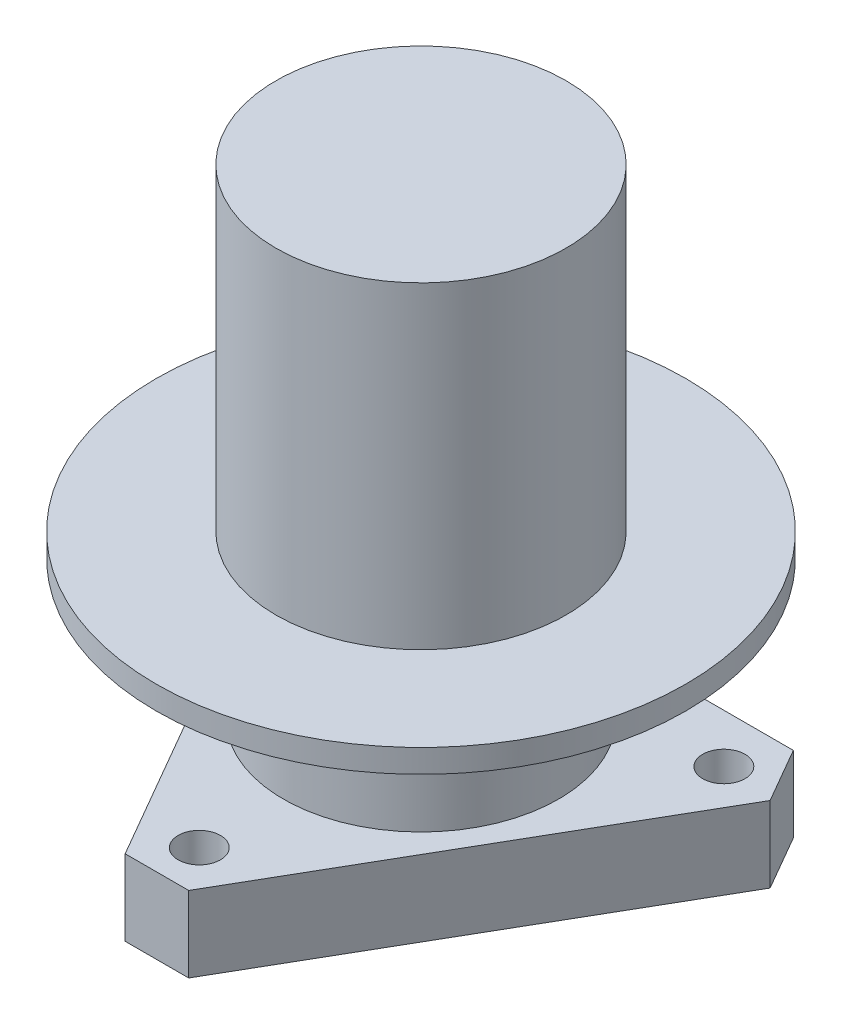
from build123d import *

# Parameters (mm, degrees)
SKETCH1_R          = 16.51
EXTRUDE1_DEPTH     = 16.764
SKETCH2_R          = 31.75
EXTRUDE2_DEPTH     = 2.794
SKETCH3_R          = 17.399
EXTRUDE3_DEPTH     = 38.1
EXTRUDE4_DEPTH     = 9.0932
SKETCH6_R          = 2.54
CUT_EXTRUDE1_DEPTH = 9.0932


with BuildPart() as part:
    # Sketch1 → Extrude1 (new body)
    with BuildSketch(Plane(origin=(0, 0, 0), x_dir=(1, 0, 0), z_dir=(0, 1, 0))):
        with Locations(Location((0, 0, 0), (0, 0, 270))):
            Circle(SKETCH1_R)
    extrude(amount=EXTRUDE1_DEPTH)

    # Sketch2 → Extrude2 (add)
    with BuildSketch(Plane(origin=(0, 16.764, 0), x_dir=(-1, 0, 0), z_dir=(0, 1, 0))):
        with Locations(Location((0, 0, 0), (0, 0, 90))):
            Circle(SKETCH2_R)
    extrude(amount=EXTRUDE2_DEPTH)

    # Sketch3 → Extrude3 (add)
    with BuildSketch(Plane(origin=(0, 19.558, 0), x_dir=(-1, 0, 0), z_dir=(0, 1, 0))):
        with Locations(Location((0, 0, 0), (0, 0, 270))):
            Circle(SKETCH3_R)
    extrude(amount=EXTRUDE3_DEPTH)

    # Sketch4 → Extrude4 (add)
    with BuildSketch(Plane(origin=(0, 0, 0), x_dir=(1, 0, 0), z_dir=(0, 1, 0))):
        Polygon((-25.519393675, 19.133037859), (25.519393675, 19.133037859), (29.329393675, 12.533924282), (3.81, -31.666962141), (-3.81, -31.666962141), (-29.329393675, 12.533924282), align=None)
    extrude(amount=-EXTRUDE4_DEPTH)

    # Sketch6 → Cut-Extrude1 (cut)
    with BuildSketch(Plane.XZ.offset(9.0932)):
        with Locations(Location((0, 26.586962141, 0), (0, 0, 270))):
            Circle(SKETCH6_R)
        with Locations(Location((-23.024984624, -13.293481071, 0), (0, 0, 270))):
            Circle(SKETCH6_R)
        with Locations(Location((23.024984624, -13.293481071, 0), (0, 0, 270))):
            Circle(SKETCH6_R)
    extrude(amount=-CUT_EXTRUDE1_DEPTH, mode=Mode.SUBTRACT)


solid = part.part
